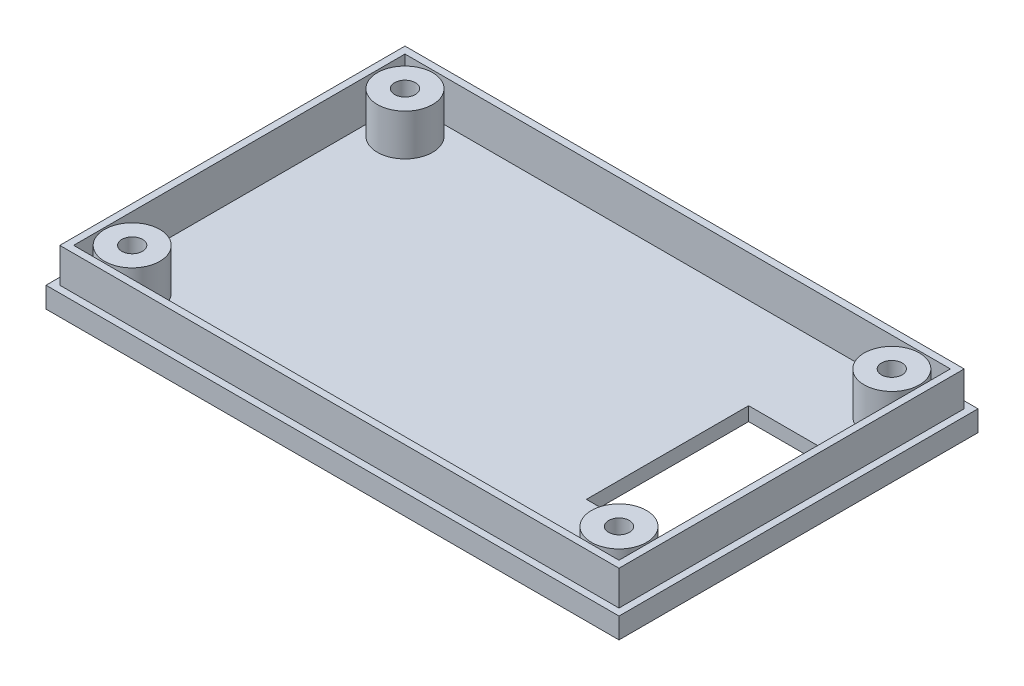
ISO-10303-21;
HEADER;
FILE_DESCRIPTION(('STEP AP214'),'2;1');
FILE_NAME('part.step','',(''),(''),'','','');
FILE_SCHEMA(('AUTOMOTIVE_DESIGN { 1 0 10303 214 1 1 1 1 }'));
ENDSEC;
DATA;
#1=APPLICATION_CONTEXT('core data for automotive mechanical design processes');
#2=APPLICATION_PROTOCOL_DEFINITION('international standard','automotive_design',2000,#1);
#3=PRODUCT_CONTEXT('',#1,'mechanical');
#4=PRODUCT('Part','Part','',(#3));
#5=PRODUCT_RELATED_PRODUCT_CATEGORY('part','',(#4));
#6=PRODUCT_DEFINITION_FORMATION('','',#4);
#7=PRODUCT_DEFINITION_CONTEXT('part definition',#1,'design');
#8=PRODUCT_DEFINITION('design','',#6,#7);
#9=PRODUCT_DEFINITION_SHAPE('','',#8);
#10=(LENGTH_UNIT() NAMED_UNIT(*) SI_UNIT(.MILLI.,.METRE.));
#11=(NAMED_UNIT(*) PLANE_ANGLE_UNIT() SI_UNIT($,.RADIAN.));
#12=(NAMED_UNIT(*) SI_UNIT($,.STERADIAN.) SOLID_ANGLE_UNIT());
#13=UNCERTAINTY_MEASURE_WITH_UNIT(LENGTH_MEASURE(1.E-05),#10,'distance_accuracy_value','');
#14=(GEOMETRIC_REPRESENTATION_CONTEXT(3) GLOBAL_UNCERTAINTY_ASSIGNED_CONTEXT((#13)) GLOBAL_UNIT_ASSIGNED_CONTEXT((#10,
#11,#12)) REPRESENTATION_CONTEXT('',''));
#15=CARTESIAN_POINT('',(0.,0.,0.));
#16=DIRECTION('',(0.,0.,1.));
#17=DIRECTION('',(1.,0.,0.));
#18=AXIS2_PLACEMENT_3D('',#15,#16,#17);
#19=CARTESIAN_POINT('',(0.,8.,0.));
#20=DIRECTION('',(0.,1.,0.));
#21=DIRECTION('',(0.,0.,1.));
#22=AXIS2_PLACEMENT_3D('',#19,#20,#21);
#23=PLANE('',#22);
#24=CARTESIAN_POINT('',(60.8159410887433,8.,-19.9960274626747));
#25=DIRECTION('',(0.,1.,0.));
#26=DIRECTION('',(0.,0.,1.));
#27=AXIS2_PLACEMENT_3D('',#24,#25,#26);
#28=CIRCLE('',#27,1.5);
#29=CARTESIAN_POINT('',(60.8159410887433,8.,-18.4960274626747));
#30=VERTEX_POINT('',#29);
#31=EDGE_CURVE('E747',#30,#30,#28,.T.);
#32=ORIENTED_EDGE('',*,*,#31,.F.);
#33=EDGE_LOOP('',(#32));
#34=FACE_BOUND('',#33,.T.);
#35=CARTESIAN_POINT('',(60.8159410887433,8.,-19.9960274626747));
#36=DIRECTION('',(0.,1.,0.));
#37=DIRECTION('',(0.,0.,1.));
#38=AXIS2_PLACEMENT_3D('',#35,#36,#37);
#39=CIRCLE('',#38,4.00000000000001);
#40=CARTESIAN_POINT('',(60.8159410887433,8.,-23.9960274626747));
#41=VERTEX_POINT('',#40);
#42=EDGE_CURVE('E215',#41,#41,#39,.T.);
#43=ORIENTED_EDGE('',*,*,#42,.T.);
#44=EDGE_LOOP('',(#43));
#45=FACE_BOUND('',#44,.T.);
#46=ADVANCED_FACE('F35',(#34,#45),#23,.T.);
#47=CARTESIAN_POINT('',(60.8159410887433,8.,19.5186911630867));
#48=DIRECTION('',(0.,1.,0.));
#49=DIRECTION('',(0.,0.,1.));
#50=AXIS2_PLACEMENT_3D('',#47,#48,#49);
#51=CIRCLE('',#50,1.5);
#52=CARTESIAN_POINT('',(60.8159410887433,8.,21.0186911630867));
#53=VERTEX_POINT('',#52);
#54=EDGE_CURVE('E746',#53,#53,#51,.T.);
#55=ORIENTED_EDGE('',*,*,#54,.F.);
#56=EDGE_LOOP('',(#55));
#57=FACE_BOUND('',#56,.T.);
#58=CARTESIAN_POINT('',(60.8159410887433,8.,19.5186911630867));
#59=DIRECTION('',(0.,1.,0.));
#60=DIRECTION('',(0.,0.,1.));
#61=AXIS2_PLACEMENT_3D('',#58,#59,#60);
#62=CIRCLE('',#61,4.);
#63=CARTESIAN_POINT('',(60.8159410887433,8.,15.5186911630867));
#64=VERTEX_POINT('',#63);
#65=EDGE_CURVE('E225',#64,#64,#62,.T.);
#66=ORIENTED_EDGE('',*,*,#65,.T.);
#67=EDGE_LOOP('',(#66));
#68=FACE_BOUND('',#67,.T.);
#69=ADVANCED_FACE('F323',(#57,#68),#23,.T.);
#70=CARTESIAN_POINT('',(-9.6987775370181,8.,19.5186911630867));
#71=DIRECTION('',(0.,1.,0.));
#72=DIRECTION('',(0.,0.,1.));
#73=AXIS2_PLACEMENT_3D('',#70,#71,#72);
#74=CIRCLE('',#73,1.5);
#75=CARTESIAN_POINT('',(-9.6987775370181,8.,21.0186911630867));
#76=VERTEX_POINT('',#75);
#77=EDGE_CURVE('E762',#76,#76,#74,.T.);
#78=ORIENTED_EDGE('',*,*,#77,.F.);
#79=EDGE_LOOP('',(#78));
#80=FACE_BOUND('',#79,.T.);
#81=CARTESIAN_POINT('',(-9.6987775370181,8.,19.5186911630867));
#82=DIRECTION('',(0.,1.,0.));
#83=DIRECTION('',(0.,0.,1.));
#84=AXIS2_PLACEMENT_3D('',#81,#82,#83);
#85=CIRCLE('',#84,4.);
#86=CARTESIAN_POINT('',(-9.6987775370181,8.,15.5186911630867));
#87=VERTEX_POINT('',#86);
#88=EDGE_CURVE('E228',#87,#87,#85,.T.);
#89=ORIENTED_EDGE('',*,*,#88,.T.);
#90=EDGE_LOOP('',(#89));
#91=FACE_BOUND('',#90,.T.);
#92=ADVANCED_FACE('F331',(#80,#91),#23,.T.);
#93=CARTESIAN_POINT('',(-9.60466787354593,8.,-19.9019177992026));
#94=DIRECTION('',(0.,1.,0.));
#95=DIRECTION('',(0.,0.,1.));
#96=AXIS2_PLACEMENT_3D('',#93,#94,#95);
#97=CIRCLE('',#96,1.5);
#98=CARTESIAN_POINT('',(-9.60466787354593,8.,-18.4019177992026));
#99=VERTEX_POINT('',#98);
#100=EDGE_CURVE('E369',#99,#99,#97,.T.);
#101=ORIENTED_EDGE('',*,*,#100,.F.);
#102=EDGE_LOOP('',(#101));
#103=FACE_BOUND('',#102,.T.);
#104=CARTESIAN_POINT('',(-9.60466787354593,8.,-19.9019177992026));
#105=DIRECTION('',(0.,1.,0.));
#106=DIRECTION('',(0.,0.,1.));
#107=AXIS2_PLACEMENT_3D('',#104,#105,#106);
#108=CIRCLE('',#107,4.);
#109=CARTESIAN_POINT('',(-9.60466787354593,8.,-23.9019177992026));
#110=VERTEX_POINT('',#109);
#111=EDGE_CURVE('E231',#110,#110,#108,.T.);
#112=ORIENTED_EDGE('',*,*,#111,.T.);
#113=EDGE_LOOP('',(#112));
#114=FACE_BOUND('',#113,.T.);
#115=ADVANCED_FACE('F335',(#103,#114),#23,.T.);
#116=CARTESIAN_POINT('',(-13.9414182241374,22.,-24.238668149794));
#117=DIRECTION('',(0.,0.,1.));
#118=DIRECTION('',(1.,0.,0.));
#119=AXIS2_PLACEMENT_3D('',#116,#117,#118);
#120=PLANE('',#119);
#121=DIRECTION('',(0.,-1.,0.));
#122=VECTOR('',#121,1.);
#123=CARTESIAN_POINT('',(65.0585817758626,22.,-24.238668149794));
#124=LINE('',#123,#122);
#125=CARTESIAN_POINT('',(65.0585817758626,8.,-24.238668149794));
#126=VERTEX_POINT('',#125);
#127=CARTESIAN_POINT('',(65.0585817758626,2.,-24.238668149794));
#128=VERTEX_POINT('',#127);
#129=EDGE_CURVE('E272',#126,#128,#124,.T.);
#130=ORIENTED_EDGE('',*,*,#129,.F.);
#131=DIRECTION('',(-1.,0.,0.));
#132=VECTOR('',#131,1.);
#133=CARTESIAN_POINT('',(-13.9414182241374,8.,-24.238668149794));
#134=LINE('',#133,#132);
#135=CARTESIAN_POINT('',(-13.9414182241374,8.,-24.238668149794));
#136=VERTEX_POINT('',#135);
#137=EDGE_CURVE('E243',#126,#136,#134,.T.);
#138=ORIENTED_EDGE('',*,*,#137,.T.);
#139=DIRECTION('',(0.,-1.,0.));
#140=VECTOR('',#139,1.);
#141=CARTESIAN_POINT('',(-13.9414182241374,22.,-24.238668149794));
#142=LINE('',#141,#140);
#143=CARTESIAN_POINT('',(-13.9414182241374,2.,-24.238668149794));
#144=VERTEX_POINT('',#143);
#145=EDGE_CURVE('E270',#136,#144,#142,.T.);
#146=ORIENTED_EDGE('',*,*,#145,.T.);
#147=DIRECTION('',(-1.,0.,0.));
#148=VECTOR('',#147,1.);
#149=CARTESIAN_POINT('',(-13.9414182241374,2.,-24.238668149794));
#150=LINE('',#149,#148);
#151=EDGE_CURVE('E267',#128,#144,#150,.T.);
#152=ORIENTED_EDGE('',*,*,#151,.F.);
#153=EDGE_LOOP('',(#130,#138,#146,#152));
#154=FACE_BOUND('',#153,.T.);
#155=ADVANCED_FACE('F355',(#154),#120,.T.);
#156=CARTESIAN_POINT('',(65.0585817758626,22.,-24.238668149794));
#157=DIRECTION('',(-1.,0.,0.));
#158=DIRECTION('',(0.,0.,1.));
#159=AXIS2_PLACEMENT_3D('',#156,#157,#158);
#160=PLANE('',#159);
#161=DIRECTION('',(0.,-1.,0.));
#162=VECTOR('',#161,1.);
#163=CARTESIAN_POINT('',(65.0585817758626,22.,23.761331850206));
#164=LINE('',#163,#162);
#165=CARTESIAN_POINT('',(65.0585817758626,8.,23.761331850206));
#166=VERTEX_POINT('',#165);
#167=CARTESIAN_POINT('',(65.0585817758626,2.,23.761331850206));
#168=VERTEX_POINT('',#167);
#169=EDGE_CURVE('E274',#166,#168,#164,.T.);
#170=ORIENTED_EDGE('',*,*,#169,.F.);
#171=DIRECTION('',(0.,0.,-1.));
#172=VECTOR('',#171,1.);
#173=CARTESIAN_POINT('',(65.0585817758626,8.,-24.238668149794));
#174=LINE('',#173,#172);
#175=EDGE_CURVE('E240',#166,#126,#174,.T.);
#176=ORIENTED_EDGE('',*,*,#175,.T.);
#177=ORIENTED_EDGE('',*,*,#129,.T.);
#178=DIRECTION('',(0.,0.,-1.));
#179=VECTOR('',#178,1.);
#180=CARTESIAN_POINT('',(65.0585817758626,2.,-24.238668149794));
#181=LINE('',#180,#179);
#182=EDGE_CURVE('E264',#168,#128,#181,.T.);
#183=ORIENTED_EDGE('',*,*,#182,.F.);
#184=EDGE_LOOP('',(#170,#176,#177,#183));
#185=FACE_BOUND('',#184,.T.);
#186=ADVANCED_FACE('F362',(#185),#160,.T.);
#187=CARTESIAN_POINT('',(-13.9414182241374,22.,23.761331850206));
#188=DIRECTION('',(0.,0.,-1.));
#189=DIRECTION('',(-1.,0.,0.));
#190=AXIS2_PLACEMENT_3D('',#187,#188,#189);
#191=PLANE('',#190);
#192=DIRECTION('',(0.,-1.,0.));
#193=VECTOR('',#192,1.);
#194=CARTESIAN_POINT('',(-13.9414182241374,22.,23.761331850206));
#195=LINE('',#194,#193);
#196=CARTESIAN_POINT('',(-13.9414182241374,8.,23.761331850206));
#197=VERTEX_POINT('',#196);
#198=CARTESIAN_POINT('',(-13.9414182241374,2.,23.761331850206));
#199=VERTEX_POINT('',#198);
#200=EDGE_CURVE('E276',#197,#199,#195,.T.);
#201=ORIENTED_EDGE('',*,*,#200,.F.);
#202=DIRECTION('',(1.,0.,0.));
#203=VECTOR('',#202,1.);
#204=CARTESIAN_POINT('',(-13.9414182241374,8.,23.761331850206));
#205=LINE('',#204,#203);
#206=EDGE_CURVE('E237',#197,#166,#205,.T.);
#207=ORIENTED_EDGE('',*,*,#206,.T.);
#208=ORIENTED_EDGE('',*,*,#169,.T.);
#209=DIRECTION('',(1.,0.,0.));
#210=VECTOR('',#209,1.);
#211=CARTESIAN_POINT('',(-13.9414182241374,2.,23.761331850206));
#212=LINE('',#211,#210);
#213=EDGE_CURVE('E261',#199,#168,#212,.T.);
#214=ORIENTED_EDGE('',*,*,#213,.F.);
#215=EDGE_LOOP('',(#201,#207,#208,#214));
#216=FACE_BOUND('',#215,.T.);
#217=ADVANCED_FACE('F385',(#216),#191,.T.);
#218=CARTESIAN_POINT('',(-13.9414182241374,22.,-24.238668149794));
#219=DIRECTION('',(1.,0.,0.));
#220=DIRECTION('',(0.,0.,-1.));
#221=AXIS2_PLACEMENT_3D('',#218,#219,#220);
#222=PLANE('',#221);
#223=ORIENTED_EDGE('',*,*,#145,.F.);
#224=DIRECTION('',(0.,0.,1.));
#225=VECTOR('',#224,1.);
#226=CARTESIAN_POINT('',(-13.9414182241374,8.,-24.238668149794));
#227=LINE('',#226,#225);
#228=EDGE_CURVE('E234',#136,#197,#227,.T.);
#229=ORIENTED_EDGE('',*,*,#228,.T.);
#230=ORIENTED_EDGE('',*,*,#200,.T.);
#231=DIRECTION('',(0.,0.,1.));
#232=VECTOR('',#231,1.);
#233=CARTESIAN_POINT('',(-13.9414182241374,2.,-24.238668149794));
#234=LINE('',#233,#232);
#235=EDGE_CURVE('E258',#144,#199,#234,.T.);
#236=ORIENTED_EDGE('',*,*,#235,.F.);
#237=EDGE_LOOP('',(#223,#229,#230,#236));
#238=FACE_BOUND('',#237,.T.);
#239=ADVANCED_FACE('F375',(#238),#222,.T.);
#240=CARTESIAN_POINT('',(-9.60466787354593,16.5,-19.9019177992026));
#241=DIRECTION('',(0.,-1.,0.));
#242=DIRECTION('',(0.,0.,-1.));
#243=AXIS2_PLACEMENT_3D('',#240,#241,#242);
#244=CYLINDRICAL_SURFACE('',#243,4.);
#245=CARTESIAN_POINT('',(-9.60466787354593,2.,-19.9019177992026));
#246=DIRECTION('',(0.,1.,0.));
#247=DIRECTION('',(0.,0.,1.));
#248=AXIS2_PLACEMENT_3D('',#245,#246,#247);
#249=CIRCLE('',#248,4.);
#250=CARTESIAN_POINT('',(-9.60466787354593,2.,-23.9019177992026));
#251=VERTEX_POINT('',#250);
#252=EDGE_CURVE('E255',#251,#251,#249,.T.);
#253=CARTESIAN_POINT('',(-9.60466787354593,2.,-23.9019177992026));
#254=CARTESIAN_POINT('',(-9.60466787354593,2.0625,-23.9019177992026));
#255=CARTESIAN_POINT('',(-9.60466787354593,2.125,-23.9019177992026));
#256=CARTESIAN_POINT('',(-9.60466787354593,2.25,-23.9019177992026));
#257=CARTESIAN_POINT('',(-9.60466787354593,2.3125,-23.9019177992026));
#258=CARTESIAN_POINT('',(-9.60466787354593,2.4375,-23.9019177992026));
#259=CARTESIAN_POINT('',(-9.60466787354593,2.5,-23.9019177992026));
#260=CARTESIAN_POINT('',(-9.60466787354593,2.625,-23.9019177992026));
#261=CARTESIAN_POINT('',(-9.60466787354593,2.6875,-23.9019177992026));
#262=CARTESIAN_POINT('',(-9.60466787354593,2.8125,-23.9019177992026));
#263=CARTESIAN_POINT('',(-9.60466787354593,2.875,-23.9019177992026));
#264=CARTESIAN_POINT('',(-9.60466787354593,3.,-23.9019177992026));
#265=CARTESIAN_POINT('',(-9.60466787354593,3.0625,-23.9019177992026));
#266=CARTESIAN_POINT('',(-9.60466787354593,3.1875,-23.9019177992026));
#267=CARTESIAN_POINT('',(-9.60466787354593,3.25,-23.9019177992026));
#268=CARTESIAN_POINT('',(-9.60466787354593,3.375,-23.9019177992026));
#269=CARTESIAN_POINT('',(-9.60466787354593,3.4375,-23.9019177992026));
#270=CARTESIAN_POINT('',(-9.60466787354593,3.5625,-23.9019177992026));
#271=CARTESIAN_POINT('',(-9.60466787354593,3.625,-23.9019177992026));
#272=CARTESIAN_POINT('',(-9.60466787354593,3.75,-23.9019177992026));
#273=CARTESIAN_POINT('',(-9.60466787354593,3.8125,-23.9019177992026));
#274=CARTESIAN_POINT('',(-9.60466787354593,3.9375,-23.9019177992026));
#275=CARTESIAN_POINT('',(-9.60466787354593,4.,-23.9019177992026));
#276=CARTESIAN_POINT('',(-9.60466787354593,4.125,-23.9019177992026));
#277=CARTESIAN_POINT('',(-9.60466787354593,4.1875,-23.9019177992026));
#278=CARTESIAN_POINT('',(-9.60466787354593,4.3125,-23.9019177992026));
#279=CARTESIAN_POINT('',(-9.60466787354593,4.375,-23.9019177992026));
#280=CARTESIAN_POINT('',(-9.60466787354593,4.5,-23.9019177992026));
#281=CARTESIAN_POINT('',(-9.60466787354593,4.5625,-23.9019177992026));
#282=CARTESIAN_POINT('',(-9.60466787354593,4.6875,-23.9019177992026));
#283=CARTESIAN_POINT('',(-9.60466787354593,4.75,-23.9019177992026));
#284=CARTESIAN_POINT('',(-9.60466787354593,4.875,-23.9019177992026));
#285=CARTESIAN_POINT('',(-9.60466787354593,4.9375,-23.9019177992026));
#286=CARTESIAN_POINT('',(-9.60466787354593,5.0625,-23.9019177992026));
#287=CARTESIAN_POINT('',(-9.60466787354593,5.125,-23.9019177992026));
#288=CARTESIAN_POINT('',(-9.60466787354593,5.25,-23.9019177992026));
#289=CARTESIAN_POINT('',(-9.60466787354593,5.3125,-23.9019177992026));
#290=CARTESIAN_POINT('',(-9.60466787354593,5.4375,-23.9019177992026));
#291=CARTESIAN_POINT('',(-9.60466787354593,5.5,-23.9019177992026));
#292=CARTESIAN_POINT('',(-9.60466787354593,5.625,-23.9019177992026));
#293=CARTESIAN_POINT('',(-9.60466787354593,5.6875,-23.9019177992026));
#294=CARTESIAN_POINT('',(-9.60466787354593,5.8125,-23.9019177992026));
#295=CARTESIAN_POINT('',(-9.60466787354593,5.875,-23.9019177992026));
#296=CARTESIAN_POINT('',(-9.60466787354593,6.,-23.9019177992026));
#297=CARTESIAN_POINT('',(-9.60466787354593,6.0625,-23.9019177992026));
#298=CARTESIAN_POINT('',(-9.60466787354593,6.1875,-23.9019177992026));
#299=CARTESIAN_POINT('',(-9.60466787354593,6.25,-23.9019177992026));
#300=CARTESIAN_POINT('',(-9.60466787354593,6.375,-23.9019177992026));
#301=CARTESIAN_POINT('',(-9.60466787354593,6.4375,-23.9019177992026));
#302=CARTESIAN_POINT('',(-9.60466787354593,6.5625,-23.9019177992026));
#303=CARTESIAN_POINT('',(-9.60466787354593,6.625,-23.9019177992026));
#304=CARTESIAN_POINT('',(-9.60466787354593,6.75,-23.9019177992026));
#305=CARTESIAN_POINT('',(-9.60466787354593,6.8125,-23.9019177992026));
#306=CARTESIAN_POINT('',(-9.60466787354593,6.9375,-23.9019177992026));
#307=CARTESIAN_POINT('',(-9.60466787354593,7.,-23.9019177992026));
#308=CARTESIAN_POINT('',(-9.60466787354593,7.125,-23.9019177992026));
#309=CARTESIAN_POINT('',(-9.60466787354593,7.1875,-23.9019177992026));
#310=CARTESIAN_POINT('',(-9.60466787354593,7.3125,-23.9019177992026));
#311=CARTESIAN_POINT('',(-9.60466787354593,7.375,-23.9019177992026));
#312=CARTESIAN_POINT('',(-9.60466787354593,7.5,-23.9019177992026));
#313=CARTESIAN_POINT('',(-9.60466787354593,7.5625,-23.9019177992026));
#314=CARTESIAN_POINT('',(-9.60466787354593,7.6875,-23.9019177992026));
#315=CARTESIAN_POINT('',(-9.60466787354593,7.75,-23.9019177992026));
#316=CARTESIAN_POINT('',(-9.60466787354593,7.875,-23.9019177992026));
#317=CARTESIAN_POINT('',(-9.60466787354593,7.9375,-23.9019177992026));
#318=CARTESIAN_POINT('',(-9.60466787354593,8.,-23.9019177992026));
#319=B_SPLINE_CURVE_WITH_KNOTS('',3,(#253,#254,#255,#256,#257,#258,#259,#260,#261,#262,#263,
#264,#265,#266,#267,#268,#269,#270,#271,#272,#273,#274,#275,#276,#277,#278,#279,#280,#281,#282,
#283,#284,#285,#286,#287,#288,#289,#290,#291,#292,#293,#294,#295,#296,#297,#298,#299,#300,#301,
#302,#303,#304,#305,#306,#307,#308,#309,#310,#311,#312,#313,#314,#315,#316,#317,#318),
.UNSPECIFIED.,.F.,.F.,(4,2,2,2,2,2,2,2,2,2,2,2,2,2,2,2,2,2,2,2,2,2,2,2,2,2,2,2,2,2,2,2,4),(0.,
0.1875,0.375,0.5625,0.750000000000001,0.937499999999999,1.125,1.3125,1.5,1.6875,1.875,2.0625,
2.25,2.4375,2.625,2.8125,3.,3.1875,3.375,3.5625,3.75,3.9375,4.125,4.3125,4.5,4.6875,4.875,
5.0625,5.25,5.4375,5.625,5.8125,6.),.UNSPECIFIED.);
#320=EDGE_CURVE('BSEAM372',#251,#110,#319,.T.);
#321=ORIENTED_EDGE('',*,*,#252,.T.);
#322=ORIENTED_EDGE('',*,*,#111,.F.);
#323=ORIENTED_EDGE('',*,*,#320,.T.);
#324=ORIENTED_EDGE('',*,*,#320,.F.);
#325=EDGE_LOOP('',(#321,#323,#322,#324));
#326=FACE_BOUND('',#325,.T.);
#327=ADVANCED_FACE('F372',(#326),#244,.T.);
#328=CARTESIAN_POINT('',(-9.6987775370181,16.5,19.5186911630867));
#329=DIRECTION('',(0.,-1.,0.));
#330=DIRECTION('',(0.,0.,-1.));
#331=AXIS2_PLACEMENT_3D('',#328,#329,#330);
#332=CYLINDRICAL_SURFACE('',#331,4.);
#333=CARTESIAN_POINT('',(-9.6987775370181,2.,19.5186911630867));
#334=DIRECTION('',(0.,1.,0.));
#335=DIRECTION('',(0.,0.,1.));
#336=AXIS2_PLACEMENT_3D('',#333,#334,#335);
#337=CIRCLE('',#336,4.);
#338=CARTESIAN_POINT('',(-9.6987775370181,2.,15.5186911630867));
#339=VERTEX_POINT('',#338);
#340=EDGE_CURVE('E252',#339,#339,#337,.T.);
#341=CARTESIAN_POINT('',(-9.6987775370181,2.,15.5186911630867));
#342=CARTESIAN_POINT('',(-9.6987775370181,2.0625,15.5186911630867));
#343=CARTESIAN_POINT('',(-9.6987775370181,2.125,15.5186911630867));
#344=CARTESIAN_POINT('',(-9.6987775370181,2.25,15.5186911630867));
#345=CARTESIAN_POINT('',(-9.6987775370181,2.3125,15.5186911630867));
#346=CARTESIAN_POINT('',(-9.6987775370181,2.4375,15.5186911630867));
#347=CARTESIAN_POINT('',(-9.6987775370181,2.5,15.5186911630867));
#348=CARTESIAN_POINT('',(-9.6987775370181,2.625,15.5186911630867));
#349=CARTESIAN_POINT('',(-9.6987775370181,2.6875,15.5186911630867));
#350=CARTESIAN_POINT('',(-9.6987775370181,2.8125,15.5186911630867));
#351=CARTESIAN_POINT('',(-9.6987775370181,2.875,15.5186911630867));
#352=CARTESIAN_POINT('',(-9.6987775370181,3.,15.5186911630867));
#353=CARTESIAN_POINT('',(-9.6987775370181,3.0625,15.5186911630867));
#354=CARTESIAN_POINT('',(-9.6987775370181,3.1875,15.5186911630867));
#355=CARTESIAN_POINT('',(-9.6987775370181,3.25,15.5186911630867));
#356=CARTESIAN_POINT('',(-9.6987775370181,3.375,15.5186911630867));
#357=CARTESIAN_POINT('',(-9.6987775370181,3.4375,15.5186911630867));
#358=CARTESIAN_POINT('',(-9.6987775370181,3.5625,15.5186911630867));
#359=CARTESIAN_POINT('',(-9.6987775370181,3.625,15.5186911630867));
#360=CARTESIAN_POINT('',(-9.6987775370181,3.75,15.5186911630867));
#361=CARTESIAN_POINT('',(-9.6987775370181,3.8125,15.5186911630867));
#362=CARTESIAN_POINT('',(-9.6987775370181,3.9375,15.5186911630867));
#363=CARTESIAN_POINT('',(-9.6987775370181,4.,15.5186911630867));
#364=CARTESIAN_POINT('',(-9.6987775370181,4.125,15.5186911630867));
#365=CARTESIAN_POINT('',(-9.6987775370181,4.1875,15.5186911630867));
#366=CARTESIAN_POINT('',(-9.6987775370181,4.3125,15.5186911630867));
#367=CARTESIAN_POINT('',(-9.6987775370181,4.375,15.5186911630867));
#368=CARTESIAN_POINT('',(-9.6987775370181,4.5,15.5186911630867));
#369=CARTESIAN_POINT('',(-9.6987775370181,4.5625,15.5186911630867));
#370=CARTESIAN_POINT('',(-9.6987775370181,4.6875,15.5186911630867));
#371=CARTESIAN_POINT('',(-9.6987775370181,4.75,15.5186911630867));
#372=CARTESIAN_POINT('',(-9.6987775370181,4.875,15.5186911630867));
#373=CARTESIAN_POINT('',(-9.6987775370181,4.9375,15.5186911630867));
#374=CARTESIAN_POINT('',(-9.6987775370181,5.0625,15.5186911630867));
#375=CARTESIAN_POINT('',(-9.6987775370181,5.125,15.5186911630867));
#376=CARTESIAN_POINT('',(-9.6987775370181,5.25,15.5186911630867));
#377=CARTESIAN_POINT('',(-9.6987775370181,5.3125,15.5186911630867));
#378=CARTESIAN_POINT('',(-9.6987775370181,5.4375,15.5186911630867));
#379=CARTESIAN_POINT('',(-9.6987775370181,5.5,15.5186911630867));
#380=CARTESIAN_POINT('',(-9.6987775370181,5.625,15.5186911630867));
#381=CARTESIAN_POINT('',(-9.6987775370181,5.6875,15.5186911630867));
#382=CARTESIAN_POINT('',(-9.6987775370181,5.8125,15.5186911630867));
#383=CARTESIAN_POINT('',(-9.6987775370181,5.875,15.5186911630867));
#384=CARTESIAN_POINT('',(-9.6987775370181,6.,15.5186911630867));
#385=CARTESIAN_POINT('',(-9.6987775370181,6.0625,15.5186911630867));
#386=CARTESIAN_POINT('',(-9.6987775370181,6.1875,15.5186911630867));
#387=CARTESIAN_POINT('',(-9.6987775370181,6.25,15.5186911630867));
#388=CARTESIAN_POINT('',(-9.6987775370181,6.375,15.5186911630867));
#389=CARTESIAN_POINT('',(-9.6987775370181,6.4375,15.5186911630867));
#390=CARTESIAN_POINT('',(-9.6987775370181,6.5625,15.5186911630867));
#391=CARTESIAN_POINT('',(-9.6987775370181,6.625,15.5186911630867));
#392=CARTESIAN_POINT('',(-9.6987775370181,6.75,15.5186911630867));
#393=CARTESIAN_POINT('',(-9.6987775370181,6.8125,15.5186911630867));
#394=CARTESIAN_POINT('',(-9.6987775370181,6.9375,15.5186911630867));
#395=CARTESIAN_POINT('',(-9.6987775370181,7.,15.5186911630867));
#396=CARTESIAN_POINT('',(-9.6987775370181,7.125,15.5186911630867));
#397=CARTESIAN_POINT('',(-9.6987775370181,7.1875,15.5186911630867));
#398=CARTESIAN_POINT('',(-9.6987775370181,7.3125,15.5186911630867));
#399=CARTESIAN_POINT('',(-9.6987775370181,7.375,15.5186911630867));
#400=CARTESIAN_POINT('',(-9.6987775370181,7.5,15.5186911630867));
#401=CARTESIAN_POINT('',(-9.6987775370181,7.5625,15.5186911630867));
#402=CARTESIAN_POINT('',(-9.6987775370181,7.6875,15.5186911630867));
#403=CARTESIAN_POINT('',(-9.6987775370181,7.75,15.5186911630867));
#404=CARTESIAN_POINT('',(-9.6987775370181,7.875,15.5186911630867));
#405=CARTESIAN_POINT('',(-9.6987775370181,7.9375,15.5186911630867));
#406=CARTESIAN_POINT('',(-9.6987775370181,8.,15.5186911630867));
#407=B_SPLINE_CURVE_WITH_KNOTS('',3,(#341,#342,#343,#344,#345,#346,#347,#348,#349,#350,#351,
#352,#353,#354,#355,#356,#357,#358,#359,#360,#361,#362,#363,#364,#365,#366,#367,#368,#369,#370,
#371,#372,#373,#374,#375,#376,#377,#378,#379,#380,#381,#382,#383,#384,#385,#386,#387,#388,#389,
#390,#391,#392,#393,#394,#395,#396,#397,#398,#399,#400,#401,#402,#403,#404,#405,#406),
.UNSPECIFIED.,.F.,.F.,(4,2,2,2,2,2,2,2,2,2,2,2,2,2,2,2,2,2,2,2,2,2,2,2,2,2,2,2,2,2,2,2,4),(0.,
0.1875,0.375,0.5625,0.750000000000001,0.937499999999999,1.125,1.3125,1.5,1.6875,1.875,2.0625,
2.25,2.4375,2.625,2.8125,3.,3.1875,3.375,3.5625,3.75,3.9375,4.125,4.3125,4.5,4.6875,4.875,
5.0625,5.25,5.4375,5.625,5.8125,6.),.UNSPECIFIED.);
#408=EDGE_CURVE('BSEAM374',#339,#87,#407,.T.);
#409=ORIENTED_EDGE('',*,*,#340,.T.);
#410=ORIENTED_EDGE('',*,*,#88,.F.);
#411=ORIENTED_EDGE('',*,*,#408,.T.);
#412=ORIENTED_EDGE('',*,*,#408,.F.);
#413=EDGE_LOOP('',(#409,#411,#410,#412));
#414=FACE_BOUND('',#413,.T.);
#415=ADVANCED_FACE('F374',(#414),#332,.T.);
#416=CARTESIAN_POINT('',(60.8159410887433,16.5,19.5186911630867));
#417=DIRECTION('',(0.,-1.,0.));
#418=DIRECTION('',(0.,0.,-1.));
#419=AXIS2_PLACEMENT_3D('',#416,#417,#418);
#420=CYLINDRICAL_SURFACE('',#419,4.);
#421=CARTESIAN_POINT('',(60.8159410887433,2.,19.5186911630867));
#422=DIRECTION('',(0.,1.,0.));
#423=DIRECTION('',(0.,0.,1.));
#424=AXIS2_PLACEMENT_3D('',#421,#422,#423);
#425=CIRCLE('',#424,4.);
#426=CARTESIAN_POINT('',(60.8159410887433,2.,15.5186911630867));
#427=VERTEX_POINT('',#426);
#428=EDGE_CURVE('E249',#427,#427,#425,.T.);
#429=CARTESIAN_POINT('',(60.8159410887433,2.,15.5186911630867));
#430=CARTESIAN_POINT('',(60.8159410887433,2.0625,15.5186911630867));
#431=CARTESIAN_POINT('',(60.8159410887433,2.125,15.5186911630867));
#432=CARTESIAN_POINT('',(60.8159410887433,2.25,15.5186911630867));
#433=CARTESIAN_POINT('',(60.8159410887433,2.3125,15.5186911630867));
#434=CARTESIAN_POINT('',(60.8159410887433,2.4375,15.5186911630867));
#435=CARTESIAN_POINT('',(60.8159410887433,2.5,15.5186911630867));
#436=CARTESIAN_POINT('',(60.8159410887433,2.625,15.5186911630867));
#437=CARTESIAN_POINT('',(60.8159410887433,2.6875,15.5186911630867));
#438=CARTESIAN_POINT('',(60.8159410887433,2.8125,15.5186911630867));
#439=CARTESIAN_POINT('',(60.8159410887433,2.875,15.5186911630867));
#440=CARTESIAN_POINT('',(60.8159410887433,3.,15.5186911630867));
#441=CARTESIAN_POINT('',(60.8159410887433,3.0625,15.5186911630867));
#442=CARTESIAN_POINT('',(60.8159410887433,3.1875,15.5186911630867));
#443=CARTESIAN_POINT('',(60.8159410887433,3.25,15.5186911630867));
#444=CARTESIAN_POINT('',(60.8159410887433,3.375,15.5186911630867));
#445=CARTESIAN_POINT('',(60.8159410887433,3.4375,15.5186911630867));
#446=CARTESIAN_POINT('',(60.8159410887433,3.5625,15.5186911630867));
#447=CARTESIAN_POINT('',(60.8159410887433,3.625,15.5186911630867));
#448=CARTESIAN_POINT('',(60.8159410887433,3.75,15.5186911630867));
#449=CARTESIAN_POINT('',(60.8159410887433,3.8125,15.5186911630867));
#450=CARTESIAN_POINT('',(60.8159410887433,3.9375,15.5186911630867));
#451=CARTESIAN_POINT('',(60.8159410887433,4.,15.5186911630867));
#452=CARTESIAN_POINT('',(60.8159410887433,4.125,15.5186911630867));
#453=CARTESIAN_POINT('',(60.8159410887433,4.1875,15.5186911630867));
#454=CARTESIAN_POINT('',(60.8159410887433,4.3125,15.5186911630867));
#455=CARTESIAN_POINT('',(60.8159410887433,4.375,15.5186911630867));
#456=CARTESIAN_POINT('',(60.8159410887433,4.5,15.5186911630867));
#457=CARTESIAN_POINT('',(60.8159410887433,4.5625,15.5186911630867));
#458=CARTESIAN_POINT('',(60.8159410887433,4.6875,15.5186911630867));
#459=CARTESIAN_POINT('',(60.8159410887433,4.75,15.5186911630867));
#460=CARTESIAN_POINT('',(60.8159410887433,4.875,15.5186911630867));
#461=CARTESIAN_POINT('',(60.8159410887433,4.9375,15.5186911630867));
#462=CARTESIAN_POINT('',(60.8159410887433,5.0625,15.5186911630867));
#463=CARTESIAN_POINT('',(60.8159410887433,5.125,15.5186911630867));
#464=CARTESIAN_POINT('',(60.8159410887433,5.25,15.5186911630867));
#465=CARTESIAN_POINT('',(60.8159410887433,5.3125,15.5186911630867));
#466=CARTESIAN_POINT('',(60.8159410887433,5.4375,15.5186911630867));
#467=CARTESIAN_POINT('',(60.8159410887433,5.5,15.5186911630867));
#468=CARTESIAN_POINT('',(60.8159410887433,5.625,15.5186911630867));
#469=CARTESIAN_POINT('',(60.8159410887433,5.6875,15.5186911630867));
#470=CARTESIAN_POINT('',(60.8159410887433,5.8125,15.5186911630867));
#471=CARTESIAN_POINT('',(60.8159410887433,5.875,15.5186911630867));
#472=CARTESIAN_POINT('',(60.8159410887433,6.,15.5186911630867));
#473=CARTESIAN_POINT('',(60.8159410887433,6.0625,15.5186911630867));
#474=CARTESIAN_POINT('',(60.8159410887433,6.1875,15.5186911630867));
#475=CARTESIAN_POINT('',(60.8159410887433,6.25,15.5186911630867));
#476=CARTESIAN_POINT('',(60.8159410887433,6.375,15.5186911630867));
#477=CARTESIAN_POINT('',(60.8159410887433,6.4375,15.5186911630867));
#478=CARTESIAN_POINT('',(60.8159410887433,6.5625,15.5186911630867));
#479=CARTESIAN_POINT('',(60.8159410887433,6.625,15.5186911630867));
#480=CARTESIAN_POINT('',(60.8159410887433,6.75,15.5186911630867));
#481=CARTESIAN_POINT('',(60.8159410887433,6.8125,15.5186911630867));
#482=CARTESIAN_POINT('',(60.8159410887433,6.9375,15.5186911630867));
#483=CARTESIAN_POINT('',(60.8159410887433,7.,15.5186911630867));
#484=CARTESIAN_POINT('',(60.8159410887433,7.125,15.5186911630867));
#485=CARTESIAN_POINT('',(60.8159410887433,7.1875,15.5186911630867));
#486=CARTESIAN_POINT('',(60.8159410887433,7.3125,15.5186911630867));
#487=CARTESIAN_POINT('',(60.8159410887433,7.375,15.5186911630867));
#488=CARTESIAN_POINT('',(60.8159410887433,7.5,15.5186911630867));
#489=CARTESIAN_POINT('',(60.8159410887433,7.5625,15.5186911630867));
#490=CARTESIAN_POINT('',(60.8159410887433,7.6875,15.5186911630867));
#491=CARTESIAN_POINT('',(60.8159410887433,7.75,15.5186911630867));
#492=CARTESIAN_POINT('',(60.8159410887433,7.875,15.5186911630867));
#493=CARTESIAN_POINT('',(60.8159410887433,7.9375,15.5186911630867));
#494=CARTESIAN_POINT('',(60.8159410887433,8.,15.5186911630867));
#495=B_SPLINE_CURVE_WITH_KNOTS('',3,(#429,#430,#431,#432,#433,#434,#435,#436,#437,#438,#439,
#440,#441,#442,#443,#444,#445,#446,#447,#448,#449,#450,#451,#452,#453,#454,#455,#456,#457,#458,
#459,#460,#461,#462,#463,#464,#465,#466,#467,#468,#469,#470,#471,#472,#473,#474,#475,#476,#477,
#478,#479,#480,#481,#482,#483,#484,#485,#486,#487,#488,#489,#490,#491,#492,#493,#494),
.UNSPECIFIED.,.F.,.F.,(4,2,2,2,2,2,2,2,2,2,2,2,2,2,2,2,2,2,2,2,2,2,2,2,2,2,2,2,2,2,2,2,4),(0.,
0.1875,0.375,0.5625,0.750000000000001,0.937499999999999,1.125,1.3125,1.5,1.6875,1.875,2.0625,
2.25,2.4375,2.625,2.8125,3.,3.1875,3.375,3.5625,3.75,3.9375,4.125,4.3125,4.5,4.6875,4.875,
5.0625,5.25,5.4375,5.625,5.8125,6.),.UNSPECIFIED.);
#496=EDGE_CURVE('BSEAM382',#427,#64,#495,.T.);
#497=ORIENTED_EDGE('',*,*,#428,.T.);
#498=ORIENTED_EDGE('',*,*,#65,.F.);
#499=ORIENTED_EDGE('',*,*,#496,.T.);
#500=ORIENTED_EDGE('',*,*,#496,.F.);
#501=EDGE_LOOP('',(#497,#499,#498,#500));
#502=FACE_BOUND('',#501,.T.);
#503=ADVANCED_FACE('F382',(#502),#420,.T.);
#504=CARTESIAN_POINT('',(60.8159410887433,16.5,-19.9960274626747));
#505=DIRECTION('',(0.,-1.,0.));
#506=DIRECTION('',(0.,0.,-1.));
#507=AXIS2_PLACEMENT_3D('',#504,#505,#506);
#508=CYLINDRICAL_SURFACE('',#507,4.00000000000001);
#509=CARTESIAN_POINT('',(60.8159410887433,2.,-19.9960274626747));
#510=DIRECTION('',(0.,1.,0.));
#511=DIRECTION('',(0.,0.,1.));
#512=AXIS2_PLACEMENT_3D('',#509,#510,#511);
#513=CIRCLE('',#512,4.00000000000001);
#514=CARTESIAN_POINT('',(60.8159410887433,2.,-23.9960274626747));
#515=VERTEX_POINT('',#514);
#516=EDGE_CURVE('E246',#515,#515,#513,.T.);
#517=CARTESIAN_POINT('',(60.8159410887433,2.,-23.9960274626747));
#518=CARTESIAN_POINT('',(60.8159410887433,2.0625,-23.9960274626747));
#519=CARTESIAN_POINT('',(60.8159410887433,2.125,-23.9960274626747));
#520=CARTESIAN_POINT('',(60.8159410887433,2.25,-23.9960274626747));
#521=CARTESIAN_POINT('',(60.8159410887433,2.3125,-23.9960274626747));
#522=CARTESIAN_POINT('',(60.8159410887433,2.4375,-23.9960274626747));
#523=CARTESIAN_POINT('',(60.8159410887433,2.5,-23.9960274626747));
#524=CARTESIAN_POINT('',(60.8159410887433,2.625,-23.9960274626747));
#525=CARTESIAN_POINT('',(60.8159410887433,2.6875,-23.9960274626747));
#526=CARTESIAN_POINT('',(60.8159410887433,2.8125,-23.9960274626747));
#527=CARTESIAN_POINT('',(60.8159410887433,2.875,-23.9960274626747));
#528=CARTESIAN_POINT('',(60.8159410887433,3.,-23.9960274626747));
#529=CARTESIAN_POINT('',(60.8159410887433,3.0625,-23.9960274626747));
#530=CARTESIAN_POINT('',(60.8159410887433,3.1875,-23.9960274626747));
#531=CARTESIAN_POINT('',(60.8159410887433,3.25,-23.9960274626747));
#532=CARTESIAN_POINT('',(60.8159410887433,3.375,-23.9960274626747));
#533=CARTESIAN_POINT('',(60.8159410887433,3.4375,-23.9960274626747));
#534=CARTESIAN_POINT('',(60.8159410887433,3.5625,-23.9960274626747));
#535=CARTESIAN_POINT('',(60.8159410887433,3.625,-23.9960274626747));
#536=CARTESIAN_POINT('',(60.8159410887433,3.75,-23.9960274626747));
#537=CARTESIAN_POINT('',(60.8159410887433,3.8125,-23.9960274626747));
#538=CARTESIAN_POINT('',(60.8159410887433,3.9375,-23.9960274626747));
#539=CARTESIAN_POINT('',(60.8159410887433,4.,-23.9960274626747));
#540=CARTESIAN_POINT('',(60.8159410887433,4.125,-23.9960274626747));
#541=CARTESIAN_POINT('',(60.8159410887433,4.1875,-23.9960274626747));
#542=CARTESIAN_POINT('',(60.8159410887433,4.3125,-23.9960274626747));
#543=CARTESIAN_POINT('',(60.8159410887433,4.375,-23.9960274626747));
#544=CARTESIAN_POINT('',(60.8159410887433,4.5,-23.9960274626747));
#545=CARTESIAN_POINT('',(60.8159410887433,4.5625,-23.9960274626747));
#546=CARTESIAN_POINT('',(60.8159410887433,4.6875,-23.9960274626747));
#547=CARTESIAN_POINT('',(60.8159410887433,4.75,-23.9960274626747));
#548=CARTESIAN_POINT('',(60.8159410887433,4.875,-23.9960274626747));
#549=CARTESIAN_POINT('',(60.8159410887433,4.9375,-23.9960274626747));
#550=CARTESIAN_POINT('',(60.8159410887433,5.0625,-23.9960274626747));
#551=CARTESIAN_POINT('',(60.8159410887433,5.125,-23.9960274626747));
#552=CARTESIAN_POINT('',(60.8159410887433,5.25,-23.9960274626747));
#553=CARTESIAN_POINT('',(60.8159410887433,5.3125,-23.9960274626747));
#554=CARTESIAN_POINT('',(60.8159410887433,5.4375,-23.9960274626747));
#555=CARTESIAN_POINT('',(60.8159410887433,5.5,-23.9960274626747));
#556=CARTESIAN_POINT('',(60.8159410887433,5.625,-23.9960274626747));
#557=CARTESIAN_POINT('',(60.8159410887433,5.6875,-23.9960274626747));
#558=CARTESIAN_POINT('',(60.8159410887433,5.8125,-23.9960274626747));
#559=CARTESIAN_POINT('',(60.8159410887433,5.875,-23.9960274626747));
#560=CARTESIAN_POINT('',(60.8159410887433,6.,-23.9960274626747));
#561=CARTESIAN_POINT('',(60.8159410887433,6.0625,-23.9960274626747));
#562=CARTESIAN_POINT('',(60.8159410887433,6.1875,-23.9960274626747));
#563=CARTESIAN_POINT('',(60.8159410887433,6.25,-23.9960274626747));
#564=CARTESIAN_POINT('',(60.8159410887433,6.375,-23.9960274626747));
#565=CARTESIAN_POINT('',(60.8159410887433,6.4375,-23.9960274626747));
#566=CARTESIAN_POINT('',(60.8159410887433,6.5625,-23.9960274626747));
#567=CARTESIAN_POINT('',(60.8159410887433,6.625,-23.9960274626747));
#568=CARTESIAN_POINT('',(60.8159410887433,6.75,-23.9960274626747));
#569=CARTESIAN_POINT('',(60.8159410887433,6.8125,-23.9960274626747));
#570=CARTESIAN_POINT('',(60.8159410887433,6.9375,-23.9960274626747));
#571=CARTESIAN_POINT('',(60.8159410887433,7.,-23.9960274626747));
#572=CARTESIAN_POINT('',(60.8159410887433,7.125,-23.9960274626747));
#573=CARTESIAN_POINT('',(60.8159410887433,7.1875,-23.9960274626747));
#574=CARTESIAN_POINT('',(60.8159410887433,7.3125,-23.9960274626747));
#575=CARTESIAN_POINT('',(60.8159410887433,7.375,-23.9960274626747));
#576=CARTESIAN_POINT('',(60.8159410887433,7.5,-23.9960274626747));
#577=CARTESIAN_POINT('',(60.8159410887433,7.5625,-23.9960274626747));
#578=CARTESIAN_POINT('',(60.8159410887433,7.6875,-23.9960274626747));
#579=CARTESIAN_POINT('',(60.8159410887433,7.75,-23.9960274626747));
#580=CARTESIAN_POINT('',(60.8159410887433,7.875,-23.9960274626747));
#581=CARTESIAN_POINT('',(60.8159410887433,7.9375,-23.9960274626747));
#582=CARTESIAN_POINT('',(60.8159410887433,8.,-23.9960274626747));
#583=B_SPLINE_CURVE_WITH_KNOTS('',3,(#517,#518,#519,#520,#521,#522,#523,#524,#525,#526,#527,
#528,#529,#530,#531,#532,#533,#534,#535,#536,#537,#538,#539,#540,#541,#542,#543,#544,#545,#546,
#547,#548,#549,#550,#551,#552,#553,#554,#555,#556,#557,#558,#559,#560,#561,#562,#563,#564,#565,
#566,#567,#568,#569,#570,#571,#572,#573,#574,#575,#576,#577,#578,#579,#580,#581,#582),
.UNSPECIFIED.,.F.,.F.,(4,2,2,2,2,2,2,2,2,2,2,2,2,2,2,2,2,2,2,2,2,2,2,2,2,2,2,2,2,2,2,2,4),(0.,
0.1875,0.375,0.5625,0.750000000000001,0.937499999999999,1.125,1.3125,1.5,1.6875,1.875,2.0625,
2.25,2.4375,2.625,2.8125,3.,3.1875,3.375,3.5625,3.75,3.9375,4.125,4.3125,4.5,4.6875,4.875,
5.0625,5.25,5.4375,5.625,5.8125,6.),.UNSPECIFIED.);
#584=EDGE_CURVE('BSEAM349',#515,#41,#583,.T.);
#585=ORIENTED_EDGE('',*,*,#516,.T.);
#586=ORIENTED_EDGE('',*,*,#42,.F.);
#587=ORIENTED_EDGE('',*,*,#584,.T.);
#588=ORIENTED_EDGE('',*,*,#584,.F.);
#589=EDGE_LOOP('',(#585,#587,#586,#588));
#590=FACE_BOUND('',#589,.T.);
#591=ADVANCED_FACE('F349',(#590),#508,.T.);
#592=CARTESIAN_POINT('',(0.,2.,0.));
#593=DIRECTION('',(0.,1.,0.));
#594=DIRECTION('',(0.,0.,1.));
#595=AXIS2_PLACEMENT_3D('',#592,#593,#594);
#596=PLANE('',#595);
#597=DIRECTION('',(0.,0.,1.));
#598=VECTOR('',#597,1.);
#599=CARTESIAN_POINT('',(49.0585817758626,2.,0.));
#600=LINE('',#599,#598);
#601=CARTESIAN_POINT('',(49.0585817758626,2.,-11.0130941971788));
#602=VERTEX_POINT('',#601);
#603=CARTESIAN_POINT('',(49.0585817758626,2.,12.4869058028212));
#604=VERTEX_POINT('',#603);
#605=EDGE_CURVE('E180',#602,#604,#600,.T.);
#606=ORIENTED_EDGE('',*,*,#605,.F.);
#607=DIRECTION('',(-1.,0.,0.));
#608=VECTOR('',#607,1.);
#609=CARTESIAN_POINT('',(0.,2.,-11.0130941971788));
#610=LINE('',#609,#608);
#611=CARTESIAN_POINT('',(62.0585817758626,2.,-11.0130941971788));
#612=VERTEX_POINT('',#611);
#613=EDGE_CURVE('E173',#612,#602,#610,.T.);
#614=ORIENTED_EDGE('',*,*,#613,.F.);
#615=DIRECTION('',(0.,0.,-1.));
#616=VECTOR('',#615,1.);
#617=CARTESIAN_POINT('',(62.0585817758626,2.,0.));
#618=LINE('',#617,#616);
#619=CARTESIAN_POINT('',(62.0585817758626,2.,12.4869058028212));
#620=VERTEX_POINT('',#619);
#621=EDGE_CURVE('E153',#620,#612,#618,.T.);
#622=ORIENTED_EDGE('',*,*,#621,.F.);
#623=DIRECTION('',(1.,0.,0.));
#624=VECTOR('',#623,1.);
#625=CARTESIAN_POINT('',(0.,2.,12.4869058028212));
#626=LINE('',#625,#624);
#627=EDGE_CURVE('E178',#604,#620,#626,.T.);
#628=ORIENTED_EDGE('',*,*,#627,.F.);
#629=EDGE_LOOP('',(#606,#614,#622,#628));
#630=FACE_BOUND('',#629,.T.);
#631=ORIENTED_EDGE('',*,*,#516,.F.);
#632=EDGE_LOOP('',(#631));
#633=FACE_BOUND('',#632,.T.);
#634=ORIENTED_EDGE('',*,*,#428,.F.);
#635=EDGE_LOOP('',(#634));
#636=FACE_BOUND('',#635,.T.);
#637=ORIENTED_EDGE('',*,*,#340,.F.);
#638=EDGE_LOOP('',(#637));
#639=FACE_BOUND('',#638,.T.);
#640=ORIENTED_EDGE('',*,*,#252,.F.);
#641=EDGE_LOOP('',(#640));
#642=FACE_BOUND('',#641,.T.);
#643=ORIENTED_EDGE('',*,*,#235,.T.);
#644=ORIENTED_EDGE('',*,*,#213,.T.);
#645=ORIENTED_EDGE('',*,*,#182,.T.);
#646=ORIENTED_EDGE('',*,*,#151,.T.);
#647=EDGE_LOOP('',(#643,#644,#645,#646));
#648=FACE_BOUND('',#647,.T.);
#649=ADVANCED_FACE('F340',(#630,#633,#636,#639,#642,#648),#596,.T.);
#650=DIRECTION('',(-1.,0.,0.));
#651=VECTOR('',#650,1.);
#652=CARTESIAN_POINT('',(0.,8.,24.7655777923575));
#653=LINE('',#652,#651);
#654=CARTESIAN_POINT('',(66.0585817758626,8.,24.7655777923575));
#655=VERTEX_POINT('',#654);
#656=CARTESIAN_POINT('',(-14.9414182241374,8.,24.7655777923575));
#657=VERTEX_POINT('',#656);
#658=EDGE_CURVE('E182',#655,#657,#653,.T.);
#659=ORIENTED_EDGE('',*,*,#658,.F.);
#660=DIRECTION('',(0.,0.,-1.));
#661=VECTOR('',#660,1.);
#662=CARTESIAN_POINT('',(66.0585817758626,8.,0.));
#663=LINE('',#662,#661);
#664=CARTESIAN_POINT('',(66.0585817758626,8.,-25.238668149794));
#665=VERTEX_POINT('',#664);
#666=EDGE_CURVE('E186',#655,#665,#663,.T.);
#667=ORIENTED_EDGE('',*,*,#666,.T.);
#668=DIRECTION('',(-1.,0.,0.));
#669=VECTOR('',#668,1.);
#670=CARTESIAN_POINT('',(0.,8.,-25.238668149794));
#671=LINE('',#670,#669);
#672=CARTESIAN_POINT('',(-14.9414182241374,8.,-25.238668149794));
#673=VERTEX_POINT('',#672);
#674=EDGE_CURVE('E208',#665,#673,#671,.T.);
#675=ORIENTED_EDGE('',*,*,#674,.T.);
#676=DIRECTION('',(0.,0.,-1.));
#677=VECTOR('',#676,1.);
#678=CARTESIAN_POINT('',(-14.9414182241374,8.,0.));
#679=LINE('',#678,#677);
#680=EDGE_CURVE('E205',#657,#673,#679,.T.);
#681=ORIENTED_EDGE('',*,*,#680,.F.);
#682=EDGE_LOOP('',(#659,#667,#675,#681));
#683=FACE_BOUND('',#682,.T.);
#684=ORIENTED_EDGE('',*,*,#175,.F.);
#685=ORIENTED_EDGE('',*,*,#206,.F.);
#686=ORIENTED_EDGE('',*,*,#228,.F.);
#687=ORIENTED_EDGE('',*,*,#137,.F.);
#688=EDGE_LOOP('',(#684,#685,#686,#687));
#689=FACE_BOUND('',#688,.T.);
#690=ADVANCED_FACE('F326',(#683,#689),#23,.T.);
#691=CARTESIAN_POINT('',(0.,3.,24.7655777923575));
#692=DIRECTION('',(0.,0.,-1.));
#693=DIRECTION('',(-1.,0.,0.));
#694=AXIS2_PLACEMENT_3D('',#691,#692,#693);
#695=PLANE('',#694);
#696=ORIENTED_EDGE('',*,*,#658,.T.);
#697=DIRECTION('',(0.,1.,0.));
#698=VECTOR('',#697,1.);
#699=CARTESIAN_POINT('',(-14.9414182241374,3.,24.7655777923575));
#700=LINE('',#699,#698);
#701=CARTESIAN_POINT('',(-14.9414182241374,3.,24.7655777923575));
#702=VERTEX_POINT('',#701);
#703=EDGE_CURVE('E203',#702,#657,#700,.T.);
#704=ORIENTED_EDGE('',*,*,#703,.F.);
#705=DIRECTION('',(-1.,0.,0.));
#706=VECTOR('',#705,1.);
#707=CARTESIAN_POINT('',(0.,3.,24.7655777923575));
#708=LINE('',#707,#706);
#709=CARTESIAN_POINT('',(66.0585817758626,3.,24.7655777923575));
#710=VERTEX_POINT('',#709);
#711=EDGE_CURVE('E192',#710,#702,#708,.T.);
#712=ORIENTED_EDGE('',*,*,#711,.F.);
#713=DIRECTION('',(0.,1.,0.));
#714=VECTOR('',#713,1.);
#715=CARTESIAN_POINT('',(66.0585817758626,3.,24.7655777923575));
#716=LINE('',#715,#714);
#717=EDGE_CURVE('E213',#710,#655,#716,.T.);
#718=ORIENTED_EDGE('',*,*,#717,.T.);
#719=EDGE_LOOP('',(#696,#704,#712,#718));
#720=FACE_BOUND('',#719,.T.);
#721=ADVANCED_FACE('F339',(#720),#695,.F.);
#722=CARTESIAN_POINT('',(66.0585817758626,3.,0.));
#723=DIRECTION('',(1.,0.,0.));
#724=DIRECTION('',(0.,0.,-1.));
#725=AXIS2_PLACEMENT_3D('',#722,#723,#724);
#726=PLANE('',#725);
#727=ORIENTED_EDGE('',*,*,#666,.F.);
#728=ORIENTED_EDGE('',*,*,#717,.F.);
#729=DIRECTION('',(0.,0.,-1.));
#730=VECTOR('',#729,1.);
#731=CARTESIAN_POINT('',(66.0585817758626,3.,0.));
#732=LINE('',#731,#730);
#733=CARTESIAN_POINT('',(66.0585817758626,3.,-25.238668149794));
#734=VERTEX_POINT('',#733);
#735=EDGE_CURVE('E200',#710,#734,#732,.T.);
#736=ORIENTED_EDGE('',*,*,#735,.T.);
#737=DIRECTION('',(0.,1.,0.));
#738=VECTOR('',#737,1.);
#739=CARTESIAN_POINT('',(66.0585817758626,3.,-25.238668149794));
#740=LINE('',#739,#738);
#741=EDGE_CURVE('E216',#734,#665,#740,.T.);
#742=ORIENTED_EDGE('',*,*,#741,.T.);
#743=EDGE_LOOP('',(#727,#728,#736,#742));
#744=FACE_BOUND('',#743,.T.);
#745=ADVANCED_FACE('F346',(#744),#726,.T.);
#746=CARTESIAN_POINT('',(0.,3.,-25.238668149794));
#747=DIRECTION('',(0.,0.,-1.));
#748=DIRECTION('',(-1.,0.,0.));
#749=AXIS2_PLACEMENT_3D('',#746,#747,#748);
#750=PLANE('',#749);
#751=ORIENTED_EDGE('',*,*,#674,.F.);
#752=ORIENTED_EDGE('',*,*,#741,.F.);
#753=DIRECTION('',(-1.,0.,0.));
#754=VECTOR('',#753,1.);
#755=CARTESIAN_POINT('',(0.,3.,-25.238668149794));
#756=LINE('',#755,#754);
#757=CARTESIAN_POINT('',(-14.9414182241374,3.,-25.238668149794));
#758=VERTEX_POINT('',#757);
#759=EDGE_CURVE('E198',#734,#758,#756,.T.);
#760=ORIENTED_EDGE('',*,*,#759,.T.);
#761=DIRECTION('',(0.,1.,0.));
#762=VECTOR('',#761,1.);
#763=CARTESIAN_POINT('',(-14.9414182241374,3.,-25.238668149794));
#764=LINE('',#763,#762);
#765=EDGE_CURVE('E219',#758,#673,#764,.T.);
#766=ORIENTED_EDGE('',*,*,#765,.T.);
#767=EDGE_LOOP('',(#751,#752,#760,#766));
#768=FACE_BOUND('',#767,.T.);
#769=ADVANCED_FACE('F537',(#768),#750,.T.);
#770=CARTESIAN_POINT('',(-14.9414182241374,3.,0.));
#771=DIRECTION('',(1.,0.,0.));
#772=DIRECTION('',(0.,0.,-1.));
#773=AXIS2_PLACEMENT_3D('',#770,#771,#772);
#774=PLANE('',#773);
#775=ORIENTED_EDGE('',*,*,#680,.T.);
#776=ORIENTED_EDGE('',*,*,#765,.F.);
#777=DIRECTION('',(0.,0.,-1.));
#778=VECTOR('',#777,1.);
#779=CARTESIAN_POINT('',(-14.9414182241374,3.,0.));
#780=LINE('',#779,#778);
#781=EDGE_CURVE('E195',#702,#758,#780,.T.);
#782=ORIENTED_EDGE('',*,*,#781,.F.);
#783=ORIENTED_EDGE('',*,*,#703,.T.);
#784=EDGE_LOOP('',(#775,#776,#782,#783));
#785=FACE_BOUND('',#784,.T.);
#786=ADVANCED_FACE('F529',(#785),#774,.F.);
#787=CARTESIAN_POINT('',(0.,3.,0.));
#788=DIRECTION('',(0.,1.,0.));
#789=DIRECTION('',(0.,0.,1.));
#790=AXIS2_PLACEMENT_3D('',#787,#788,#789);
#791=PLANE('',#790);
#792=DIRECTION('',(-1.,0.,0.));
#793=VECTOR('',#792,1.);
#794=CARTESIAN_POINT('',(0.,3.,-26.238668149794));
#795=LINE('',#794,#793);
#796=CARTESIAN_POINT('',(67.0585817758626,3.,-26.238668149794));
#797=VERTEX_POINT('',#796);
#798=CARTESIAN_POINT('',(-15.9414182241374,3.,-26.238668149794));
#799=VERTEX_POINT('',#798);
#800=EDGE_CURVE('E183',#797,#799,#795,.T.);
#801=ORIENTED_EDGE('',*,*,#800,.T.);
#802=DIRECTION('',(0.,0.,1.));
#803=VECTOR('',#802,1.);
#804=CARTESIAN_POINT('',(-15.9414182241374,3.,0.));
#805=LINE('',#804,#803);
#806=CARTESIAN_POINT('',(-15.9414182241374,3.,25.761331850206));
#807=VERTEX_POINT('',#806);
#808=EDGE_CURVE('E185',#799,#807,#805,.T.);
#809=ORIENTED_EDGE('',*,*,#808,.T.);
#810=DIRECTION('',(1.,0.,0.));
#811=VECTOR('',#810,1.);
#812=CARTESIAN_POINT('',(0.,3.,25.761331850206));
#813=LINE('',#812,#811);
#814=CARTESIAN_POINT('',(67.0585817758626,3.,25.761331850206));
#815=VERTEX_POINT('',#814);
#816=EDGE_CURVE('E188',#807,#815,#813,.T.);
#817=ORIENTED_EDGE('',*,*,#816,.T.);
#818=DIRECTION('',(0.,0.,-1.));
#819=VECTOR('',#818,1.);
#820=CARTESIAN_POINT('',(67.0585817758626,3.,0.));
#821=LINE('',#820,#819);
#822=EDGE_CURVE('E190',#815,#797,#821,.T.);
#823=ORIENTED_EDGE('',*,*,#822,.T.);
#824=EDGE_LOOP('',(#801,#809,#817,#823));
#825=FACE_BOUND('',#824,.T.);
#826=ORIENTED_EDGE('',*,*,#711,.T.);
#827=ORIENTED_EDGE('',*,*,#781,.T.);
#828=ORIENTED_EDGE('',*,*,#759,.F.);
#829=ORIENTED_EDGE('',*,*,#735,.F.);
#830=EDGE_LOOP('',(#826,#827,#828,#829));
#831=FACE_BOUND('',#830,.T.);
#832=ADVANCED_FACE('F312',(#825,#831),#791,.T.);
#833=CARTESIAN_POINT('',(0.,0.,0.));
#834=DIRECTION('',(0.,1.,0.));
#835=DIRECTION('',(0.,0.,1.));
#836=AXIS2_PLACEMENT_3D('',#833,#834,#835);
#837=PLANE('',#836);
#838=DIRECTION('',(1.,0.,0.));
#839=VECTOR('',#838,1.);
#840=CARTESIAN_POINT('',(49.0585817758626,0.,-11.0130941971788));
#841=LINE('',#840,#839);
#842=CARTESIAN_POINT('',(49.0585817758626,0.,-11.0130941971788));
#843=VERTEX_POINT('',#842);
#844=CARTESIAN_POINT('',(62.0585817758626,0.,-11.0130941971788));
#845=VERTEX_POINT('',#844);
#846=EDGE_CURVE('E159',#843,#845,#841,.T.);
#847=ORIENTED_EDGE('',*,*,#846,.F.);
#848=DIRECTION('',(0.,0.,-1.));
#849=VECTOR('',#848,1.);
#850=CARTESIAN_POINT('',(49.0585817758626,0.,12.4869058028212));
#851=LINE('',#850,#849);
#852=CARTESIAN_POINT('',(49.0585817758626,0.,12.4869058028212));
#853=VERTEX_POINT('',#852);
#854=EDGE_CURVE('E58',#853,#843,#851,.T.);
#855=ORIENTED_EDGE('',*,*,#854,.F.);
#856=DIRECTION('',(-1.,0.,0.));
#857=VECTOR('',#856,1.);
#858=CARTESIAN_POINT('',(49.0585817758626,0.,12.4869058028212));
#859=LINE('',#858,#857);
#860=CARTESIAN_POINT('',(62.0585817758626,0.,12.4869058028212));
#861=VERTEX_POINT('',#860);
#862=EDGE_CURVE('E166',#861,#853,#859,.T.);
#863=ORIENTED_EDGE('',*,*,#862,.F.);
#864=DIRECTION('',(0.,0.,1.));
#865=VECTOR('',#864,1.);
#866=CARTESIAN_POINT('',(62.0585817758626,0.,12.4869058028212));
#867=LINE('',#866,#865);
#868=EDGE_CURVE('E150',#845,#861,#867,.T.);
#869=ORIENTED_EDGE('',*,*,#868,.F.);
#870=EDGE_LOOP('',(#847,#855,#863,#869));
#871=FACE_BOUND('',#870,.T.);
#872=DIRECTION('',(0.,0.,1.));
#873=VECTOR('',#872,1.);
#874=CARTESIAN_POINT('',(-15.9414182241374,0.,-26.238668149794));
#875=LINE('',#874,#873);
#876=CARTESIAN_POINT('',(-15.9414182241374,0.,-26.238668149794));
#877=VERTEX_POINT('',#876);
#878=CARTESIAN_POINT('',(-15.9414182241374,0.,25.761331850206));
#879=VERTEX_POINT('',#878);
#880=EDGE_CURVE('E278',#877,#879,#875,.T.);
#881=ORIENTED_EDGE('',*,*,#880,.F.);
#882=DIRECTION('',(-1.,0.,0.));
#883=VECTOR('',#882,1.);
#884=CARTESIAN_POINT('',(67.0585817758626,0.,-26.238668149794));
#885=LINE('',#884,#883);
#886=CARTESIAN_POINT('',(67.0585817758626,0.,-26.238668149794));
#887=VERTEX_POINT('',#886);
#888=EDGE_CURVE('E287',#887,#877,#885,.T.);
#889=ORIENTED_EDGE('',*,*,#888,.F.);
#890=DIRECTION('',(0.,0.,-1.));
#891=VECTOR('',#890,1.);
#892=CARTESIAN_POINT('',(67.0585817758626,0.,25.761331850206));
#893=LINE('',#892,#891);
#894=CARTESIAN_POINT('',(67.0585817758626,0.,25.761331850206));
#895=VERTEX_POINT('',#894);
#896=EDGE_CURVE('E284',#895,#887,#893,.T.);
#897=ORIENTED_EDGE('',*,*,#896,.F.);
#898=DIRECTION('',(1.,0.,0.));
#899=VECTOR('',#898,1.);
#900=CARTESIAN_POINT('',(-15.9414182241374,0.,25.761331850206));
#901=LINE('',#900,#899);
#902=EDGE_CURVE('E281',#879,#895,#901,.T.);
#903=ORIENTED_EDGE('',*,*,#902,.F.);
#904=EDGE_LOOP('',(#881,#889,#897,#903));
#905=FACE_BOUND('',#904,.T.);
#906=ADVANCED_FACE('F163',(#871,#905),#837,.F.);
#907=CARTESIAN_POINT('',(-15.9414182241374,2.,-26.238668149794));
#908=DIRECTION('',(1.,0.,0.));
#909=DIRECTION('',(0.,0.,-1.));
#910=AXIS2_PLACEMENT_3D('',#907,#908,#909);
#911=PLANE('',#910);
#912=ORIENTED_EDGE('',*,*,#808,.F.);
#913=DIRECTION('',(0.,-1.,0.));
#914=VECTOR('',#913,1.);
#915=CARTESIAN_POINT('',(-15.9414182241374,2.,-26.238668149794));
#916=LINE('',#915,#914);
#917=EDGE_CURVE('E290',#799,#877,#916,.T.);
#918=ORIENTED_EDGE('',*,*,#917,.T.);
#919=ORIENTED_EDGE('',*,*,#880,.T.);
#920=DIRECTION('',(0.,-1.,0.));
#921=VECTOR('',#920,1.);
#922=CARTESIAN_POINT('',(-15.9414182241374,2.,25.761331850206));
#923=LINE('',#922,#921);
#924=EDGE_CURVE('E11',#807,#879,#923,.T.);
#925=ORIENTED_EDGE('',*,*,#924,.F.);
#926=EDGE_LOOP('',(#912,#918,#919,#925));
#927=FACE_BOUND('',#926,.T.);
#928=ADVANCED_FACE('F37',(#927),#911,.F.);
#929=CARTESIAN_POINT('',(-15.9414182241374,2.,25.761331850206));
#930=DIRECTION('',(0.,0.,-1.));
#931=DIRECTION('',(-1.,0.,0.));
#932=AXIS2_PLACEMENT_3D('',#929,#930,#931);
#933=PLANE('',#932);
#934=ORIENTED_EDGE('',*,*,#816,.F.);
#935=ORIENTED_EDGE('',*,*,#924,.T.);
#936=ORIENTED_EDGE('',*,*,#902,.T.);
#937=DIRECTION('',(0.,-1.,0.));
#938=VECTOR('',#937,1.);
#939=CARTESIAN_POINT('',(67.0585817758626,2.,25.761331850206));
#940=LINE('',#939,#938);
#941=EDGE_CURVE('E43',#815,#895,#940,.T.);
#942=ORIENTED_EDGE('',*,*,#941,.F.);
#943=EDGE_LOOP('',(#934,#935,#936,#942));
#944=FACE_BOUND('',#943,.T.);
#945=ADVANCED_FACE('F303',(#944),#933,.F.);
#946=CARTESIAN_POINT('',(67.0585817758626,2.,25.761331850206));
#947=DIRECTION('',(-1.,0.,0.));
#948=DIRECTION('',(0.,0.,1.));
#949=AXIS2_PLACEMENT_3D('',#946,#947,#948);
#950=PLANE('',#949);
#951=ORIENTED_EDGE('',*,*,#822,.F.);
#952=ORIENTED_EDGE('',*,*,#941,.T.);
#953=ORIENTED_EDGE('',*,*,#896,.T.);
#954=DIRECTION('',(0.,-1.,0.));
#955=VECTOR('',#954,1.);
#956=CARTESIAN_POINT('',(67.0585817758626,2.,-26.238668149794));
#957=LINE('',#956,#955);
#958=EDGE_CURVE('E292',#797,#887,#957,.T.);
#959=ORIENTED_EDGE('',*,*,#958,.F.);
#960=EDGE_LOOP('',(#951,#952,#953,#959));
#961=FACE_BOUND('',#960,.T.);
#962=ADVANCED_FACE('F296',(#961),#950,.F.);
#963=CARTESIAN_POINT('',(67.0585817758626,2.,-26.238668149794));
#964=DIRECTION('',(0.,0.,1.));
#965=DIRECTION('',(1.,0.,0.));
#966=AXIS2_PLACEMENT_3D('',#963,#964,#965);
#967=PLANE('',#966);
#968=ORIENTED_EDGE('',*,*,#800,.F.);
#969=ORIENTED_EDGE('',*,*,#958,.T.);
#970=ORIENTED_EDGE('',*,*,#888,.T.);
#971=ORIENTED_EDGE('',*,*,#917,.F.);
#972=EDGE_LOOP('',(#968,#969,#970,#971));
#973=FACE_BOUND('',#972,.T.);
#974=ADVANCED_FACE('F309',(#973),#967,.F.);
#975=CARTESIAN_POINT('',(49.0585817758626,5.,12.4869058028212));
#976=DIRECTION('',(-1.,0.,0.));
#977=DIRECTION('',(0.,0.,1.));
#978=AXIS2_PLACEMENT_3D('',#975,#976,#977);
#979=PLANE('',#978);
#980=ORIENTED_EDGE('',*,*,#605,.T.);
#981=DIRECTION('',(0.,-1.,0.));
#982=VECTOR('',#981,1.);
#983=CARTESIAN_POINT('',(49.0585817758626,5.,12.4869058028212));
#984=LINE('',#983,#982);
#985=EDGE_CURVE('E171',#604,#853,#984,.T.);
#986=ORIENTED_EDGE('',*,*,#985,.T.);
#987=ORIENTED_EDGE('',*,*,#854,.T.);
#988=DIRECTION('',(0.,-1.,0.));
#989=VECTOR('',#988,1.);
#990=CARTESIAN_POINT('',(49.0585817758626,5.,-11.0130941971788));
#991=LINE('',#990,#989);
#992=EDGE_CURVE('E156',#602,#843,#991,.T.);
#993=ORIENTED_EDGE('',*,*,#992,.F.);
#994=EDGE_LOOP('',(#980,#986,#987,#993));
#995=FACE_BOUND('',#994,.T.);
#996=ADVANCED_FACE('F398',(#995),#979,.F.);
#997=CARTESIAN_POINT('',(49.0585817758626,5.,12.4869058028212));
#998=DIRECTION('',(0.,0.,1.));
#999=DIRECTION('',(1.,0.,0.));
#1000=AXIS2_PLACEMENT_3D('',#997,#998,#999);
#1001=PLANE('',#1000);
#1002=ORIENTED_EDGE('',*,*,#627,.T.);
#1003=DIRECTION('',(0.,-1.,0.));
#1004=VECTOR('',#1003,1.);
#1005=CARTESIAN_POINT('',(62.0585817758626,5.,12.4869058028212));
#1006=LINE('',#1005,#1004);
#1007=EDGE_CURVE('E155',#620,#861,#1006,.T.);
#1008=ORIENTED_EDGE('',*,*,#1007,.T.);
#1009=ORIENTED_EDGE('',*,*,#862,.T.);
#1010=ORIENTED_EDGE('',*,*,#985,.F.);
#1011=EDGE_LOOP('',(#1002,#1008,#1009,#1010));
#1012=FACE_BOUND('',#1011,.T.);
#1013=ADVANCED_FACE('F414',(#1012),#1001,.F.);
#1014=CARTESIAN_POINT('',(62.0585817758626,5.,12.4869058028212));
#1015=DIRECTION('',(1.,0.,0.));
#1016=DIRECTION('',(0.,0.,-1.));
#1017=AXIS2_PLACEMENT_3D('',#1014,#1015,#1016);
#1018=PLANE('',#1017);
#1019=ORIENTED_EDGE('',*,*,#621,.T.);
#1020=DIRECTION('',(0.,-1.,0.));
#1021=VECTOR('',#1020,1.);
#1022=CARTESIAN_POINT('',(62.0585817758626,5.,-11.0130941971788));
#1023=LINE('',#1022,#1021);
#1024=EDGE_CURVE('E50',#612,#845,#1023,.T.);
#1025=ORIENTED_EDGE('',*,*,#1024,.T.);
#1026=ORIENTED_EDGE('',*,*,#868,.T.);
#1027=ORIENTED_EDGE('',*,*,#1007,.F.);
#1028=EDGE_LOOP('',(#1019,#1025,#1026,#1027));
#1029=FACE_BOUND('',#1028,.T.);
#1030=ADVANCED_FACE('F147',(#1029),#1018,.F.);
#1031=CARTESIAN_POINT('',(49.0585817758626,5.,-11.0130941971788));
#1032=DIRECTION('',(0.,0.,-1.));
#1033=DIRECTION('',(-1.,0.,0.));
#1034=AXIS2_PLACEMENT_3D('',#1031,#1032,#1033);
#1035=PLANE('',#1034);
#1036=ORIENTED_EDGE('',*,*,#613,.T.);
#1037=ORIENTED_EDGE('',*,*,#992,.T.);
#1038=ORIENTED_EDGE('',*,*,#846,.T.);
#1039=ORIENTED_EDGE('',*,*,#1024,.F.);
#1040=EDGE_LOOP('',(#1036,#1037,#1038,#1039));
#1041=FACE_BOUND('',#1040,.T.);
#1042=ADVANCED_FACE('F160',(#1041),#1035,.F.);
#1043=CARTESIAN_POINT('',(-9.60466787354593,5.,-19.9019177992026));
#1044=DIRECTION('',(0.,1.,0.));
#1045=DIRECTION('',(0.,0.,1.));
#1046=AXIS2_PLACEMENT_3D('',#1043,#1044,#1045);
#1047=CYLINDRICAL_SURFACE('',#1046,1.5);
#1048=CARTESIAN_POINT('',(-9.60466787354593,5.,-19.9019177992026));
#1049=DIRECTION('',(0.,1.,0.));
#1050=DIRECTION('',(0.,0.,1.));
#1051=AXIS2_PLACEMENT_3D('',#1048,#1049,#1050);
#1052=CIRCLE('',#1051,1.5);
#1053=CARTESIAN_POINT('',(-9.60466787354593,5.,-18.4019177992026));
#1054=VERTEX_POINT('',#1053);
#1055=EDGE_CURVE('E753',#1054,#1054,#1052,.T.);
#1056=ORIENTED_EDGE('',*,*,#1055,.F.);
#1057=EDGE_LOOP('',(#1056));
#1058=FACE_BOUND('',#1057,.T.);
#1059=ORIENTED_EDGE('',*,*,#100,.T.);
#1060=EDGE_LOOP('',(#1059));
#1061=FACE_BOUND('',#1060,.T.);
#1062=ADVANCED_FACE('F434',(#1058,#1061),#1047,.F.);
#1063=CARTESIAN_POINT('',(-9.60466787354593,5.,-19.9019177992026));
#1064=DIRECTION('',(0.,1.,0.));
#1065=DIRECTION('',(0.,0.,1.));
#1066=AXIS2_PLACEMENT_3D('',#1063,#1064,#1065);
#1067=PLANE('',#1066);
#1068=ORIENTED_EDGE('',*,*,#1055,.T.);
#1069=EDGE_LOOP('',(#1068));
#1070=FACE_BOUND('',#1069,.T.);
#1071=ADVANCED_FACE('F440',(#1070),#1067,.T.);
#1072=CARTESIAN_POINT('',(-9.6987775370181,5.,19.5186911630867));
#1073=DIRECTION('',(0.,1.,0.));
#1074=DIRECTION('',(0.,0.,1.));
#1075=AXIS2_PLACEMENT_3D('',#1072,#1073,#1074);
#1076=CYLINDRICAL_SURFACE('',#1075,1.5);
#1077=CARTESIAN_POINT('',(-9.6987775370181,5.,19.5186911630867));
#1078=DIRECTION('',(0.,1.,0.));
#1079=DIRECTION('',(0.,0.,1.));
#1080=AXIS2_PLACEMENT_3D('',#1077,#1078,#1079);
#1081=CIRCLE('',#1080,1.5);
#1082=CARTESIAN_POINT('',(-9.6987775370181,5.,21.0186911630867));
#1083=VERTEX_POINT('',#1082);
#1084=EDGE_CURVE('E759',#1083,#1083,#1081,.T.);
#1085=ORIENTED_EDGE('',*,*,#1084,.F.);
#1086=EDGE_LOOP('',(#1085));
#1087=FACE_BOUND('',#1086,.T.);
#1088=ORIENTED_EDGE('',*,*,#77,.T.);
#1089=EDGE_LOOP('',(#1088));
#1090=FACE_BOUND('',#1089,.T.);
#1091=ADVANCED_FACE('F448',(#1087,#1090),#1076,.F.);
#1092=CARTESIAN_POINT('',(-9.6987775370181,5.,19.5186911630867));
#1093=DIRECTION('',(0.,1.,0.));
#1094=DIRECTION('',(0.,0.,1.));
#1095=AXIS2_PLACEMENT_3D('',#1092,#1093,#1094);
#1096=PLANE('',#1095);
#1097=ORIENTED_EDGE('',*,*,#1084,.T.);
#1098=EDGE_LOOP('',(#1097));
#1099=FACE_BOUND('',#1098,.T.);
#1100=ADVANCED_FACE('F456',(#1099),#1096,.T.);
#1101=CARTESIAN_POINT('',(60.8159410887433,5.,19.5186911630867));
#1102=DIRECTION('',(0.,1.,0.));
#1103=DIRECTION('',(0.,0.,1.));
#1104=AXIS2_PLACEMENT_3D('',#1101,#1102,#1103);
#1105=CYLINDRICAL_SURFACE('',#1104,1.5);
#1106=CARTESIAN_POINT('',(60.8159410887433,5.,19.5186911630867));
#1107=DIRECTION('',(0.,1.,0.));
#1108=DIRECTION('',(0.,0.,1.));
#1109=AXIS2_PLACEMENT_3D('',#1106,#1107,#1108);
#1110=CIRCLE('',#1109,1.5);
#1111=CARTESIAN_POINT('',(60.8159410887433,5.,21.0186911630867));
#1112=VERTEX_POINT('',#1111);
#1113=EDGE_CURVE('E750',#1112,#1112,#1110,.T.);
#1114=ORIENTED_EDGE('',*,*,#1113,.F.);
#1115=EDGE_LOOP('',(#1114));
#1116=FACE_BOUND('',#1115,.T.);
#1117=ORIENTED_EDGE('',*,*,#54,.T.);
#1118=EDGE_LOOP('',(#1117));
#1119=FACE_BOUND('',#1118,.T.);
#1120=ADVANCED_FACE('F464',(#1116,#1119),#1105,.F.);
#1121=CARTESIAN_POINT('',(60.8159410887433,5.,19.5186911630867));
#1122=DIRECTION('',(0.,1.,0.));
#1123=DIRECTION('',(0.,0.,1.));
#1124=AXIS2_PLACEMENT_3D('',#1121,#1122,#1123);
#1125=PLANE('',#1124);
#1126=ORIENTED_EDGE('',*,*,#1113,.T.);
#1127=EDGE_LOOP('',(#1126));
#1128=FACE_BOUND('',#1127,.T.);
#1129=ADVANCED_FACE('F472',(#1128),#1125,.T.);
#1130=CARTESIAN_POINT('',(60.8159410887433,5.,-19.9960274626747));
#1131=DIRECTION('',(0.,1.,0.));
#1132=DIRECTION('',(0.,0.,1.));
#1133=AXIS2_PLACEMENT_3D('',#1130,#1131,#1132);
#1134=CYLINDRICAL_SURFACE('',#1133,1.5);
#1135=CARTESIAN_POINT('',(60.8159410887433,5.,-19.9960274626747));
#1136=DIRECTION('',(0.,1.,0.));
#1137=DIRECTION('',(0.,0.,1.));
#1138=AXIS2_PLACEMENT_3D('',#1135,#1136,#1137);
#1139=CIRCLE('',#1138,1.5);
#1140=CARTESIAN_POINT('',(60.8159410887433,5.,-18.4960274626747));
#1141=VERTEX_POINT('',#1140);
#1142=EDGE_CURVE('E745',#1141,#1141,#1139,.T.);
#1143=ORIENTED_EDGE('',*,*,#1142,.F.);
#1144=EDGE_LOOP('',(#1143));
#1145=FACE_BOUND('',#1144,.T.);
#1146=ORIENTED_EDGE('',*,*,#31,.T.);
#1147=EDGE_LOOP('',(#1146));
#1148=FACE_BOUND('',#1147,.T.);
#1149=ADVANCED_FACE('F480',(#1145,#1148),#1134,.F.);
#1150=CARTESIAN_POINT('',(60.8159410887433,5.,-19.9960274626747));
#1151=DIRECTION('',(0.,1.,0.));
#1152=DIRECTION('',(0.,0.,1.));
#1153=AXIS2_PLACEMENT_3D('',#1150,#1151,#1152);
#1154=PLANE('',#1153);
#1155=ORIENTED_EDGE('',*,*,#1142,.T.);
#1156=EDGE_LOOP('',(#1155));
#1157=FACE_BOUND('',#1156,.T.);
#1158=ADVANCED_FACE('F488',(#1157),#1154,.T.);
#1159=CLOSED_SHELL('',(#46,#69,#92,#115,#155,#186,#217,#239,#327,#415,#503,#591,#649,#690,#721,
#745,#769,#786,#832,#906,#928,#945,#962,#974,#996,#1013,#1030,#1042,#1062,#1071,#1091,#1100,
#1120,#1129,#1149,#1158));
#1160=MANIFOLD_SOLID_BREP('B2',#1159);
#1161=ADVANCED_BREP_SHAPE_REPRESENTATION('',(#18,#1160),#14);
#1162=SHAPE_DEFINITION_REPRESENTATION(#9,#1161);
ENDSEC;
END-ISO-10303-21;
